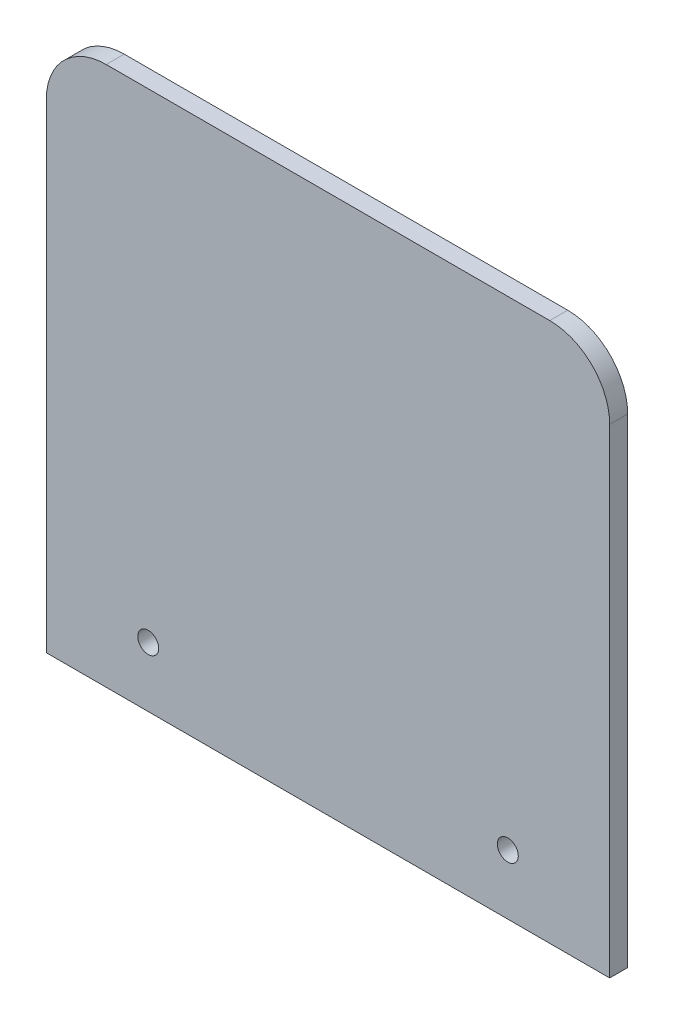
from build123d import *

# Parameters (mm, degrees)
SKETCH1_R      = 1.75
EXTRUDE1_DEPTH = 3


with BuildPart() as part:
    # Sketch1 → Extrude1 (new body)
    with BuildSketch(Plane.XY):
        with BuildLine():
            Line((0, 0), (94, 0))
            Line((94, 0), (94, 80))
            ThreePointArc((94, 80), (91.071067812, 87.071067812), (84, 90))
            Line((84, 90), (10, 90))
            ThreePointArc((10, 90), (2.928932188, 87.071067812), (0, 80))
            Line((0, 80), (0, 0))
        make_face()
        with Locations((77, 10)):
            Circle(SKETCH1_R, mode=Mode.SUBTRACT)
        with Locations((17, 10)):
            Circle(SKETCH1_R, mode=Mode.SUBTRACT)
    extrude(amount=EXTRUDE1_DEPTH)


solid = part.part
